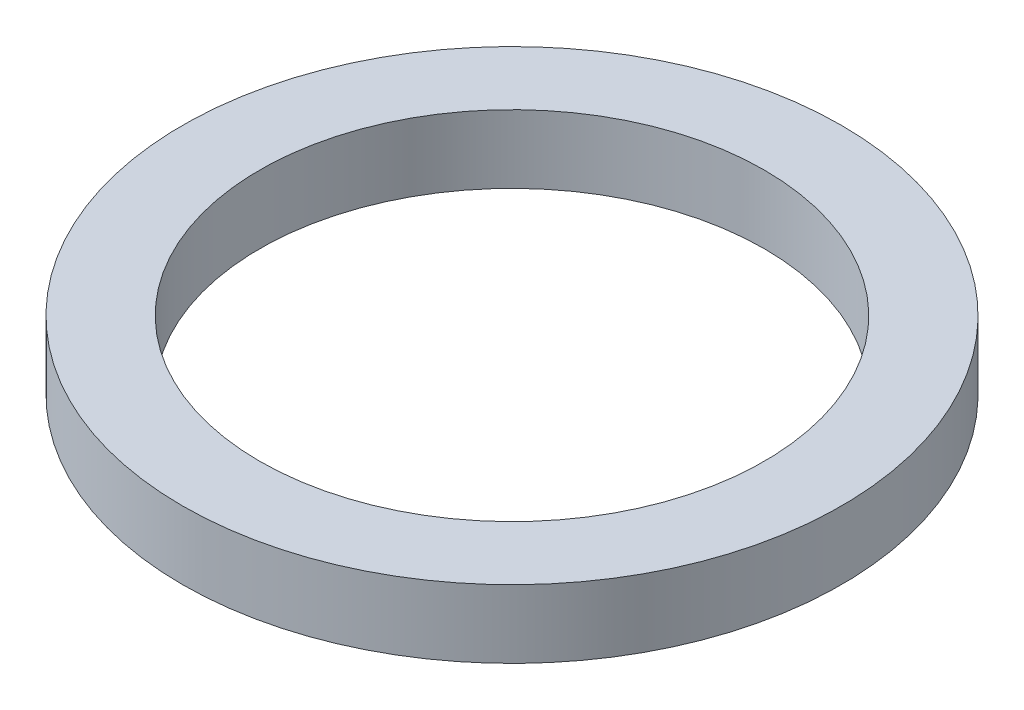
ISO-10303-21;
HEADER;
FILE_DESCRIPTION(('STEP AP214'),'2;1');
FILE_NAME('part.step','',(''),(''),'','','');
FILE_SCHEMA(('AUTOMOTIVE_DESIGN { 1 0 10303 214 1 1 1 1 }'));
ENDSEC;
DATA;
#1=APPLICATION_CONTEXT('core data for automotive mechanical design processes');
#2=APPLICATION_PROTOCOL_DEFINITION('international standard','automotive_design',2000,#1);
#3=PRODUCT_CONTEXT('',#1,'mechanical');
#4=PRODUCT('Part','Part','',(#3));
#5=PRODUCT_RELATED_PRODUCT_CATEGORY('part','',(#4));
#6=PRODUCT_DEFINITION_FORMATION('','',#4);
#7=PRODUCT_DEFINITION_CONTEXT('part definition',#1,'design');
#8=PRODUCT_DEFINITION('design','',#6,#7);
#9=PRODUCT_DEFINITION_SHAPE('','',#8);
#10=(LENGTH_UNIT() NAMED_UNIT(*) SI_UNIT(.MILLI.,.METRE.));
#11=(NAMED_UNIT(*) PLANE_ANGLE_UNIT() SI_UNIT($,.RADIAN.));
#12=(NAMED_UNIT(*) SI_UNIT($,.STERADIAN.) SOLID_ANGLE_UNIT());
#13=UNCERTAINTY_MEASURE_WITH_UNIT(LENGTH_MEASURE(1.E-05),#10,'distance_accuracy_value','');
#14=(GEOMETRIC_REPRESENTATION_CONTEXT(3) GLOBAL_UNCERTAINTY_ASSIGNED_CONTEXT((#13)) GLOBAL_UNIT_ASSIGNED_CONTEXT((#10,
#11,#12)) REPRESENTATION_CONTEXT('',''));
#15=CARTESIAN_POINT('',(0.,0.,0.));
#16=DIRECTION('',(0.,0.,1.));
#17=DIRECTION('',(1.,0.,0.));
#18=AXIS2_PLACEMENT_3D('',#15,#16,#17);
#19=CARTESIAN_POINT('',(0.,18.8488780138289,0.));
#20=DIRECTION('',(0.,1.,0.));
#21=DIRECTION('',(0.,0.,1.));
#22=AXIS2_PLACEMENT_3D('',#19,#20,#21);
#23=CYLINDRICAL_SURFACE('',#22,11.1);
#24=CARTESIAN_POINT('',(0.,-3.,0.));
#25=DIRECTION('',(0.,1.,0.));
#26=DIRECTION('',(0.,0.,1.));
#27=AXIS2_PLACEMENT_3D('',#24,#25,#26);
#28=CIRCLE('',#27,11.1);
#29=CARTESIAN_POINT('',(0.,-3.,11.1));
#30=VERTEX_POINT('',#29);
#31=EDGE_CURVE('E10',#30,#30,#28,.T.);
#32=ORIENTED_EDGE('',*,*,#31,.F.);
#33=EDGE_LOOP('',(#32));
#34=FACE_BOUND('',#33,.T.);
#35=CARTESIAN_POINT('',(0.,0.,0.));
#36=DIRECTION('',(0.,1.,0.));
#37=DIRECTION('',(0.,0.,1.));
#38=AXIS2_PLACEMENT_3D('',#35,#36,#37);
#39=CIRCLE('',#38,11.1);
#40=CARTESIAN_POINT('',(0.,0.,11.1));
#41=VERTEX_POINT('',#40);
#42=EDGE_CURVE('E45',#41,#41,#39,.T.);
#43=ORIENTED_EDGE('',*,*,#42,.T.);
#44=EDGE_LOOP('',(#43));
#45=FACE_BOUND('',#44,.T.);
#46=ADVANCED_FACE('F31',(#34,#45),#23,.F.);
#47=CARTESIAN_POINT('',(0.,-3.,-11.1));
#48=DIRECTION('',(0.,1.,0.));
#49=DIRECTION('',(0.,0.,1.));
#50=AXIS2_PLACEMENT_3D('',#47,#48,#49);
#51=PLANE('',#50);
#52=CARTESIAN_POINT('',(0.,-3.,0.));
#53=DIRECTION('',(0.,1.,0.));
#54=DIRECTION('',(0.,0.,1.));
#55=AXIS2_PLACEMENT_3D('',#52,#53,#54);
#56=CIRCLE('',#55,14.5);
#57=CARTESIAN_POINT('',(0.,-3.,14.5));
#58=VERTEX_POINT('',#57);
#59=EDGE_CURVE('E37',#58,#58,#56,.T.);
#60=ORIENTED_EDGE('',*,*,#59,.F.);
#61=EDGE_LOOP('',(#60));
#62=FACE_BOUND('',#61,.T.);
#63=ORIENTED_EDGE('',*,*,#31,.T.);
#64=EDGE_LOOP('',(#63));
#65=FACE_BOUND('',#64,.T.);
#66=ADVANCED_FACE('F60',(#62,#65),#51,.F.);
#67=CARTESIAN_POINT('',(0.,18.8488780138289,0.));
#68=DIRECTION('',(0.,1.,0.));
#69=DIRECTION('',(0.,0.,1.));
#70=AXIS2_PLACEMENT_3D('',#67,#68,#69);
#71=CYLINDRICAL_SURFACE('',#70,14.5);
#72=CARTESIAN_POINT('',(0.,0.,0.));
#73=DIRECTION('',(0.,1.,0.));
#74=DIRECTION('',(0.,0.,1.));
#75=AXIS2_PLACEMENT_3D('',#72,#73,#74);
#76=CIRCLE('',#75,14.5);
#77=CARTESIAN_POINT('',(0.,0.,14.5));
#78=VERTEX_POINT('',#77);
#79=EDGE_CURVE('E41',#78,#78,#76,.T.);
#80=ORIENTED_EDGE('',*,*,#79,.F.);
#81=EDGE_LOOP('',(#80));
#82=FACE_BOUND('',#81,.T.);
#83=ORIENTED_EDGE('',*,*,#59,.T.);
#84=EDGE_LOOP('',(#83));
#85=FACE_BOUND('',#84,.T.);
#86=ADVANCED_FACE('F55',(#82,#85),#71,.T.);
#87=CARTESIAN_POINT('',(0.,0.,-11.1));
#88=DIRECTION('',(0.,-1.,0.));
#89=DIRECTION('',(0.,0.,-1.));
#90=AXIS2_PLACEMENT_3D('',#87,#88,#89);
#91=PLANE('',#90);
#92=ORIENTED_EDGE('',*,*,#42,.F.);
#93=EDGE_LOOP('',(#92));
#94=FACE_BOUND('',#93,.T.);
#95=ORIENTED_EDGE('',*,*,#79,.T.);
#96=EDGE_LOOP('',(#95));
#97=FACE_BOUND('',#96,.T.);
#98=ADVANCED_FACE('F52',(#94,#97),#91,.F.);
#99=CLOSED_SHELL('',(#46,#66,#86,#98));
#100=MANIFOLD_SOLID_BREP('B2',#99);
#101=ADVANCED_BREP_SHAPE_REPRESENTATION('',(#18,#100),#14);
#102=SHAPE_DEFINITION_REPRESENTATION(#9,#101);
ENDSEC;
END-ISO-10303-21;
